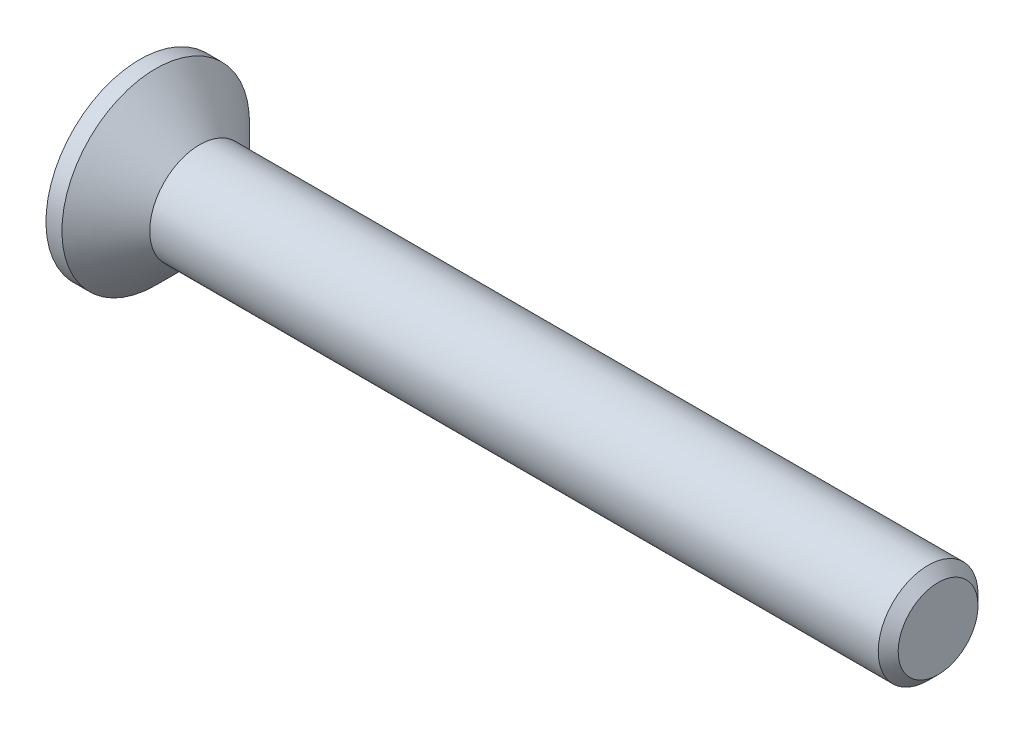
ISO-10303-21;
HEADER;
FILE_DESCRIPTION(('STEP AP214'),'2;1');
FILE_NAME('part.step','',(''),(''),'','','');
FILE_SCHEMA(('AUTOMOTIVE_DESIGN { 1 0 10303 214 1 1 1 1 }'));
ENDSEC;
DATA;
#1=APPLICATION_CONTEXT('core data for automotive mechanical design processes');
#2=APPLICATION_PROTOCOL_DEFINITION('international standard','automotive_design',2000,#1);
#3=PRODUCT_CONTEXT('',#1,'mechanical');
#4=PRODUCT('Part','Part','',(#3));
#5=PRODUCT_RELATED_PRODUCT_CATEGORY('part','',(#4));
#6=PRODUCT_DEFINITION_FORMATION('','',#4);
#7=PRODUCT_DEFINITION_CONTEXT('part definition',#1,'design');
#8=PRODUCT_DEFINITION('design','',#6,#7);
#9=PRODUCT_DEFINITION_SHAPE('','',#8);
#10=(LENGTH_UNIT() NAMED_UNIT(*) SI_UNIT(.MILLI.,.METRE.));
#11=(NAMED_UNIT(*) PLANE_ANGLE_UNIT() SI_UNIT($,.RADIAN.));
#12=(NAMED_UNIT(*) SI_UNIT($,.STERADIAN.) SOLID_ANGLE_UNIT());
#13=UNCERTAINTY_MEASURE_WITH_UNIT(LENGTH_MEASURE(1.E-05),#10,'distance_accuracy_value','');
#14=(GEOMETRIC_REPRESENTATION_CONTEXT(3) GLOBAL_UNCERTAINTY_ASSIGNED_CONTEXT((#13)) GLOBAL_UNIT_ASSIGNED_CONTEXT((#10,
#11,#12)) REPRESENTATION_CONTEXT('',''));
#15=CARTESIAN_POINT('',(0.,0.,0.));
#16=DIRECTION('',(0.,0.,1.));
#17=DIRECTION('',(1.,0.,0.));
#18=AXIS2_PLACEMENT_3D('',#15,#16,#17);
#19=CARTESIAN_POINT('',(0.,0.,0.));
#20=DIRECTION('',(-1.,0.,0.));
#21=DIRECTION('',(0.,-1.,0.));
#22=AXIS2_PLACEMENT_3D('',#19,#20,#21);
#23=CONICAL_SURFACE('',#22,1.25,0.78539816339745);
#24=CARTESIAN_POINT('',(-1.1,0.,0.));
#25=DIRECTION('',(-1.,0.,0.));
#26=DIRECTION('',(0.,-1.,0.));
#27=AXIS2_PLACEMENT_3D('',#24,#25,#26);
#28=CIRCLE('',#27,2.35);
#29=CARTESIAN_POINT('',(-1.1,-2.35,0.));
#30=VERTEX_POINT('',#29);
#31=EDGE_CURVE('E189',#30,#30,#28,.T.);
#32=ORIENTED_EDGE('',*,*,#31,.F.);
#33=EDGE_LOOP('',(#32));
#34=FACE_BOUND('',#33,.T.);
#35=CARTESIAN_POINT('',(0.,0.,0.));
#36=DIRECTION('',(-1.,0.,0.));
#37=DIRECTION('',(0.,-1.,0.));
#38=AXIS2_PLACEMENT_3D('',#35,#36,#37);
#39=CIRCLE('',#38,1.25);
#40=CARTESIAN_POINT('',(0.,-1.25,0.));
#41=VERTEX_POINT('',#40);
#42=EDGE_CURVE('E212',#41,#41,#39,.T.);
#43=ORIENTED_EDGE('',*,*,#42,.T.);
#44=EDGE_LOOP('',(#43));
#45=FACE_BOUND('',#44,.T.);
#46=ADVANCED_FACE('F33',(#34,#45),#23,.T.);
#47=CARTESIAN_POINT('',(-1.5,0.,0.));
#48=DIRECTION('',(-1.,0.,0.));
#49=DIRECTION('',(0.,-1.,0.));
#50=AXIS2_PLACEMENT_3D('',#47,#48,#49);
#51=CYLINDRICAL_SURFACE('',#50,1.25);
#52=CARTESIAN_POINT('',(18.25,0.,0.));
#53=DIRECTION('',(-1.,0.,0.));
#54=DIRECTION('',(0.,-1.,0.));
#55=AXIS2_PLACEMENT_3D('',#52,#53,#54);
#56=CIRCLE('',#55,1.25);
#57=CARTESIAN_POINT('',(18.25,-1.25,0.));
#58=VERTEX_POINT('',#57);
#59=EDGE_CURVE('E41',#58,#58,#56,.T.);
#60=ORIENTED_EDGE('',*,*,#59,.T.);
#61=EDGE_LOOP('',(#60));
#62=FACE_BOUND('',#61,.T.);
#63=ORIENTED_EDGE('',*,*,#42,.F.);
#64=EDGE_LOOP('',(#63));
#65=FACE_BOUND('',#64,.T.);
#66=ADVANCED_FACE('F217',(#62,#65),#51,.T.);
#67=CARTESIAN_POINT('',(18.5,0.,0.));
#68=DIRECTION('',(-1.,0.,0.));
#69=DIRECTION('',(0.,-1.,0.));
#70=AXIS2_PLACEMENT_3D('',#67,#68,#69);
#71=PLANE('',#70);
#72=CARTESIAN_POINT('',(18.5,0.,0.));
#73=DIRECTION('',(-1.,0.,0.));
#74=DIRECTION('',(0.,-1.,0.));
#75=AXIS2_PLACEMENT_3D('',#72,#73,#74);
#76=CIRCLE('',#75,0.999999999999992);
#77=CARTESIAN_POINT('',(18.5,-0.999999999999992,0.));
#78=VERTEX_POINT('',#77);
#79=EDGE_CURVE('E11',#78,#78,#76,.F.);
#80=ORIENTED_EDGE('',*,*,#79,.T.);
#81=EDGE_LOOP('',(#80));
#82=FACE_BOUND('',#81,.T.);
#83=ADVANCED_FACE('F239',(#82),#71,.F.);
#84=CARTESIAN_POINT('',(-1.5,2.35,0.));
#85=DIRECTION('',(1.,0.,0.));
#86=DIRECTION('',(0.,1.,0.));
#87=AXIS2_PLACEMENT_3D('',#84,#85,#86);
#88=PLANE('',#87);
#89=DIRECTION('',(0.,0.,-1.));
#90=VECTOR('',#89,1.);
#91=CARTESIAN_POINT('',(-1.5,0.34,-1.35));
#92=LINE('',#91,#90);
#93=CARTESIAN_POINT('',(-1.5,0.34,-0.34));
#94=VERTEX_POINT('',#93);
#95=CARTESIAN_POINT('',(-1.5,0.34,-1.35));
#96=VERTEX_POINT('',#95);
#97=EDGE_CURVE('E158',#94,#96,#92,.T.);
#98=ORIENTED_EDGE('',*,*,#97,.F.);
#99=DIRECTION('',(0.,-1.,0.));
#100=VECTOR('',#99,1.);
#101=CARTESIAN_POINT('',(-1.5,0.34,-0.34));
#102=LINE('',#101,#100);
#103=CARTESIAN_POINT('',(-1.5,1.35,-0.34));
#104=VERTEX_POINT('',#103);
#105=EDGE_CURVE('E48',#104,#94,#102,.T.);
#106=ORIENTED_EDGE('',*,*,#105,.F.);
#107=DIRECTION('',(0.,0.,-1.));
#108=VECTOR('',#107,1.);
#109=CARTESIAN_POINT('',(-1.5,1.35,-0.34));
#110=LINE('',#109,#108);
#111=CARTESIAN_POINT('',(-1.5,1.35,0.34));
#112=VERTEX_POINT('',#111);
#113=EDGE_CURVE('E185',#112,#104,#110,.T.);
#114=ORIENTED_EDGE('',*,*,#113,.F.);
#115=DIRECTION('',(0.,1.,0.));
#116=VECTOR('',#115,1.);
#117=CARTESIAN_POINT('',(-1.5,1.35,0.34));
#118=LINE('',#117,#116);
#119=CARTESIAN_POINT('',(-1.5,0.34,0.34));
#120=VERTEX_POINT('',#119);
#121=EDGE_CURVE('E183',#120,#112,#118,.T.);
#122=ORIENTED_EDGE('',*,*,#121,.F.);
#123=DIRECTION('',(0.,0.,-1.));
#124=VECTOR('',#123,1.);
#125=CARTESIAN_POINT('',(-1.5,0.34,0.34));
#126=LINE('',#125,#124);
#127=CARTESIAN_POINT('',(-1.5,0.34,1.35));
#128=VERTEX_POINT('',#127);
#129=EDGE_CURVE('E132',#128,#120,#126,.T.);
#130=ORIENTED_EDGE('',*,*,#129,.F.);
#131=DIRECTION('',(0.,1.,0.));
#132=VECTOR('',#131,1.);
#133=CARTESIAN_POINT('',(-1.5,0.34,1.35));
#134=LINE('',#133,#132);
#135=CARTESIAN_POINT('',(-1.5,-0.34,1.35));
#136=VERTEX_POINT('',#135);
#137=EDGE_CURVE('E179',#136,#128,#134,.T.);
#138=ORIENTED_EDGE('',*,*,#137,.F.);
#139=DIRECTION('',(0.,0.,1.));
#140=VECTOR('',#139,1.);
#141=CARTESIAN_POINT('',(-1.5,-0.34,1.35));
#142=LINE('',#141,#140);
#143=CARTESIAN_POINT('',(-1.5,-0.34,0.34));
#144=VERTEX_POINT('',#143);
#145=EDGE_CURVE('E176',#144,#136,#142,.T.);
#146=ORIENTED_EDGE('',*,*,#145,.F.);
#147=DIRECTION('',(0.,1.,0.));
#148=VECTOR('',#147,1.);
#149=CARTESIAN_POINT('',(-1.5,-0.34,0.34));
#150=LINE('',#149,#148);
#151=CARTESIAN_POINT('',(-1.5,-1.35,0.34));
#152=VERTEX_POINT('',#151);
#153=EDGE_CURVE('E173',#152,#144,#150,.T.);
#154=ORIENTED_EDGE('',*,*,#153,.F.);
#155=DIRECTION('',(0.,0.,1.));
#156=VECTOR('',#155,1.);
#157=CARTESIAN_POINT('',(-1.5,-1.35,0.34));
#158=LINE('',#157,#156);
#159=CARTESIAN_POINT('',(-1.5,-1.35,-0.34));
#160=VERTEX_POINT('',#159);
#161=EDGE_CURVE('E170',#160,#152,#158,.T.);
#162=ORIENTED_EDGE('',*,*,#161,.F.);
#163=DIRECTION('',(0.,-1.,0.));
#164=VECTOR('',#163,1.);
#165=CARTESIAN_POINT('',(-1.5,-1.35,-0.34));
#166=LINE('',#165,#164);
#167=CARTESIAN_POINT('',(-1.5,-0.34,-0.34));
#168=VERTEX_POINT('',#167);
#169=EDGE_CURVE('E167',#168,#160,#166,.T.);
#170=ORIENTED_EDGE('',*,*,#169,.F.);
#171=DIRECTION('',(0.,0.,1.));
#172=VECTOR('',#171,1.);
#173=CARTESIAN_POINT('',(-1.5,-0.34,-0.34));
#174=LINE('',#173,#172);
#175=CARTESIAN_POINT('',(-1.5,-0.34,-1.35));
#176=VERTEX_POINT('',#175);
#177=EDGE_CURVE('E164',#176,#168,#174,.T.);
#178=ORIENTED_EDGE('',*,*,#177,.F.);
#179=DIRECTION('',(0.,-1.,0.));
#180=VECTOR('',#179,1.);
#181=CARTESIAN_POINT('',(-1.5,-0.34,-1.35));
#182=LINE('',#181,#180);
#183=EDGE_CURVE('E161',#96,#176,#182,.T.);
#184=ORIENTED_EDGE('',*,*,#183,.F.);
#185=EDGE_LOOP('',(#98,#106,#114,#122,#130,#138,#146,#154,#162,#170,#178,#184));
#186=FACE_BOUND('',#185,.T.);
#187=CARTESIAN_POINT('',(-1.5,0.,0.));
#188=DIRECTION('',(-1.,0.,0.));
#189=DIRECTION('',(0.,-1.,0.));
#190=AXIS2_PLACEMENT_3D('',#187,#188,#189);
#191=CIRCLE('',#190,2.35);
#192=CARTESIAN_POINT('',(-1.5,-2.35,0.));
#193=VERTEX_POINT('',#192);
#194=EDGE_CURVE('E209',#193,#193,#191,.T.);
#195=ORIENTED_EDGE('',*,*,#194,.T.);
#196=EDGE_LOOP('',(#195));
#197=FACE_BOUND('',#196,.T.);
#198=ADVANCED_FACE('F230',(#186,#197),#88,.F.);
#199=CARTESIAN_POINT('',(-1.5,0.,0.));
#200=DIRECTION('',(-1.,0.,0.));
#201=DIRECTION('',(0.,-1.,0.));
#202=AXIS2_PLACEMENT_3D('',#199,#200,#201);
#203=CYLINDRICAL_SURFACE('',#202,2.35);
#204=ORIENTED_EDGE('',*,*,#194,.F.);
#205=EDGE_LOOP('',(#204));
#206=FACE_BOUND('',#205,.T.);
#207=ORIENTED_EDGE('',*,*,#31,.T.);
#208=EDGE_LOOP('',(#207));
#209=FACE_BOUND('',#208,.T.);
#210=ADVANCED_FACE('F222',(#206,#209),#203,.T.);
#211=CARTESIAN_POINT('',(18.25,0.,0.));
#212=DIRECTION('',(-1.,0.,0.));
#213=DIRECTION('',(0.,-1.,0.));
#214=AXIS2_PLACEMENT_3D('',#211,#212,#213);
#215=CONICAL_SURFACE('',#214,1.25,0.785398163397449);
#216=ORIENTED_EDGE('',*,*,#79,.F.);
#217=EDGE_LOOP('',(#216));
#218=FACE_BOUND('',#217,.T.);
#219=ORIENTED_EDGE('',*,*,#59,.F.);
#220=EDGE_LOOP('',(#219));
#221=FACE_BOUND('',#220,.T.);
#222=ADVANCED_FACE('F35',(#218,#221),#215,.T.);
#223=CARTESIAN_POINT('',(-0.25,0.34,-0.34));
#224=DIRECTION('',(0.,0.,-1.));
#225=DIRECTION('',(-1.,0.,0.));
#226=AXIS2_PLACEMENT_3D('',#223,#224,#225);
#227=PLANE('',#226);
#228=ORIENTED_EDGE('',*,*,#105,.T.);
#229=DIRECTION('',(-1.,0.,0.));
#230=VECTOR('',#229,1.);
#231=CARTESIAN_POINT('',(-0.25,0.34,-0.34));
#232=LINE('',#231,#230);
#233=CARTESIAN_POINT('',(-0.25,0.34,-0.34));
#234=VERTEX_POINT('',#233);
#235=EDGE_CURVE('E96',#234,#94,#232,.T.);
#236=ORIENTED_EDGE('',*,*,#235,.F.);
#237=DIRECTION('',(0.,-1.,0.));
#238=VECTOR('',#237,1.);
#239=CARTESIAN_POINT('',(-0.25,0.34,-0.34));
#240=LINE('',#239,#238);
#241=CARTESIAN_POINT('',(-0.25,1.35,-0.34));
#242=VERTEX_POINT('',#241);
#243=EDGE_CURVE('E187',#242,#234,#240,.T.);
#244=ORIENTED_EDGE('',*,*,#243,.F.);
#245=DIRECTION('',(-1.,0.,0.));
#246=VECTOR('',#245,1.);
#247=CARTESIAN_POINT('',(-0.25,1.35,-0.34));
#248=LINE('',#247,#246);
#249=EDGE_CURVE('E56',#242,#104,#248,.T.);
#250=ORIENTED_EDGE('',*,*,#249,.T.);
#251=EDGE_LOOP('',(#228,#236,#244,#250));
#252=FACE_BOUND('',#251,.T.);
#253=ADVANCED_FACE('F221',(#252),#227,.F.);
#254=CARTESIAN_POINT('',(-0.25,1.35,-0.34));
#255=DIRECTION('',(0.,1.,0.));
#256=DIRECTION('',(-1.,0.,0.));
#257=AXIS2_PLACEMENT_3D('',#254,#255,#256);
#258=PLANE('',#257);
#259=ORIENTED_EDGE('',*,*,#113,.T.);
#260=ORIENTED_EDGE('',*,*,#249,.F.);
#261=DIRECTION('',(0.,0.,-1.));
#262=VECTOR('',#261,1.);
#263=CARTESIAN_POINT('',(-0.25,1.35,-0.34));
#264=LINE('',#263,#262);
#265=CARTESIAN_POINT('',(-0.25,1.35,0.34));
#266=VERTEX_POINT('',#265);
#267=EDGE_CURVE('E144',#266,#242,#264,.T.);
#268=ORIENTED_EDGE('',*,*,#267,.F.);
#269=DIRECTION('',(-1.,0.,0.));
#270=VECTOR('',#269,1.);
#271=CARTESIAN_POINT('',(-0.25,1.35,0.34));
#272=LINE('',#271,#270);
#273=EDGE_CURVE('E136',#266,#112,#272,.T.);
#274=ORIENTED_EDGE('',*,*,#273,.T.);
#275=EDGE_LOOP('',(#259,#260,#268,#274));
#276=FACE_BOUND('',#275,.T.);
#277=ADVANCED_FACE('F228',(#276),#258,.F.);
#278=CARTESIAN_POINT('',(-0.25,1.35,0.34));
#279=DIRECTION('',(0.,0.,1.));
#280=DIRECTION('',(1.,0.,0.));
#281=AXIS2_PLACEMENT_3D('',#278,#279,#280);
#282=PLANE('',#281);
#283=ORIENTED_EDGE('',*,*,#121,.T.);
#284=ORIENTED_EDGE('',*,*,#273,.F.);
#285=DIRECTION('',(0.,1.,0.));
#286=VECTOR('',#285,1.);
#287=CARTESIAN_POINT('',(-0.25,1.35,0.34));
#288=LINE('',#287,#286);
#289=CARTESIAN_POINT('',(-0.25,0.34,0.34));
#290=VERTEX_POINT('',#289);
#291=EDGE_CURVE('E140',#290,#266,#288,.T.);
#292=ORIENTED_EDGE('',*,*,#291,.F.);
#293=DIRECTION('',(-1.,0.,0.));
#294=VECTOR('',#293,1.);
#295=CARTESIAN_POINT('',(-0.25,0.34,0.34));
#296=LINE('',#295,#294);
#297=EDGE_CURVE('E125',#290,#120,#296,.T.);
#298=ORIENTED_EDGE('',*,*,#297,.T.);
#299=EDGE_LOOP('',(#283,#284,#292,#298));
#300=FACE_BOUND('',#299,.T.);
#301=ADVANCED_FACE('F141',(#300),#282,.F.);
#302=CARTESIAN_POINT('',(-0.25,0.34,0.34));
#303=DIRECTION('',(0.,1.,0.));
#304=DIRECTION('',(-1.,0.,0.));
#305=AXIS2_PLACEMENT_3D('',#302,#303,#304);
#306=PLANE('',#305);
#307=ORIENTED_EDGE('',*,*,#129,.T.);
#308=ORIENTED_EDGE('',*,*,#297,.F.);
#309=DIRECTION('',(0.,0.,-1.));
#310=VECTOR('',#309,1.);
#311=CARTESIAN_POINT('',(-0.25,0.34,0.34));
#312=LINE('',#311,#310);
#313=CARTESIAN_POINT('',(-0.25,0.34,1.35));
#314=VERTEX_POINT('',#313);
#315=EDGE_CURVE('E129',#314,#290,#312,.T.);
#316=ORIENTED_EDGE('',*,*,#315,.F.);
#317=DIRECTION('',(-1.,0.,0.));
#318=VECTOR('',#317,1.);
#319=CARTESIAN_POINT('',(-0.25,0.34,1.35));
#320=LINE('',#319,#318);
#321=EDGE_CURVE('E137',#314,#128,#320,.T.);
#322=ORIENTED_EDGE('',*,*,#321,.T.);
#323=EDGE_LOOP('',(#307,#308,#316,#322));
#324=FACE_BOUND('',#323,.T.);
#325=ADVANCED_FACE('F127',(#324),#306,.F.);
#326=CARTESIAN_POINT('',(-0.25,0.34,1.35));
#327=DIRECTION('',(0.,0.,1.));
#328=DIRECTION('',(1.,0.,0.));
#329=AXIS2_PLACEMENT_3D('',#326,#327,#328);
#330=PLANE('',#329);
#331=ORIENTED_EDGE('',*,*,#137,.T.);
#332=ORIENTED_EDGE('',*,*,#321,.F.);
#333=DIRECTION('',(0.,1.,0.));
#334=VECTOR('',#333,1.);
#335=CARTESIAN_POINT('',(-0.25,0.34,1.35));
#336=LINE('',#335,#334);
#337=CARTESIAN_POINT('',(-0.25,-0.34,1.35));
#338=VERTEX_POINT('',#337);
#339=EDGE_CURVE('E150',#338,#314,#336,.T.);
#340=ORIENTED_EDGE('',*,*,#339,.F.);
#341=DIRECTION('',(-1.,0.,0.));
#342=VECTOR('',#341,1.);
#343=CARTESIAN_POINT('',(-0.25,-0.34,1.35));
#344=LINE('',#343,#342);
#345=EDGE_CURVE('E192',#338,#136,#344,.T.);
#346=ORIENTED_EDGE('',*,*,#345,.T.);
#347=EDGE_LOOP('',(#331,#332,#340,#346));
#348=FACE_BOUND('',#347,.T.);
#349=ADVANCED_FACE('F277',(#348),#330,.F.);
#350=CARTESIAN_POINT('',(-0.25,-0.34,1.35));
#351=DIRECTION('',(0.,-1.,0.));
#352=DIRECTION('',(1.,0.,0.));
#353=AXIS2_PLACEMENT_3D('',#350,#351,#352);
#354=PLANE('',#353);
#355=ORIENTED_EDGE('',*,*,#145,.T.);
#356=ORIENTED_EDGE('',*,*,#345,.F.);
#357=DIRECTION('',(0.,0.,1.));
#358=VECTOR('',#357,1.);
#359=CARTESIAN_POINT('',(-0.25,-0.34,1.35));
#360=LINE('',#359,#358);
#361=CARTESIAN_POINT('',(-0.25,-0.34,0.34));
#362=VERTEX_POINT('',#361);
#363=EDGE_CURVE('E152',#362,#338,#360,.T.);
#364=ORIENTED_EDGE('',*,*,#363,.F.);
#365=DIRECTION('',(-1.,0.,0.));
#366=VECTOR('',#365,1.);
#367=CARTESIAN_POINT('',(-0.25,-0.34,0.34));
#368=LINE('',#367,#366);
#369=EDGE_CURVE('E194',#362,#144,#368,.T.);
#370=ORIENTED_EDGE('',*,*,#369,.T.);
#371=EDGE_LOOP('',(#355,#356,#364,#370));
#372=FACE_BOUND('',#371,.T.);
#373=ADVANCED_FACE('F273',(#372),#354,.F.);
#374=CARTESIAN_POINT('',(-0.25,-0.34,0.34));
#375=DIRECTION('',(0.,0.,1.));
#376=DIRECTION('',(1.,0.,0.));
#377=AXIS2_PLACEMENT_3D('',#374,#375,#376);
#378=PLANE('',#377);
#379=ORIENTED_EDGE('',*,*,#153,.T.);
#380=ORIENTED_EDGE('',*,*,#369,.F.);
#381=DIRECTION('',(0.,1.,0.));
#382=VECTOR('',#381,1.);
#383=CARTESIAN_POINT('',(-0.25,-0.34,0.34));
#384=LINE('',#383,#382);
#385=CARTESIAN_POINT('',(-0.25,-1.35,0.34));
#386=VERTEX_POINT('',#385);
#387=EDGE_CURVE('E422',#386,#362,#384,.T.);
#388=ORIENTED_EDGE('',*,*,#387,.F.);
#389=DIRECTION('',(-1.,0.,0.));
#390=VECTOR('',#389,1.);
#391=CARTESIAN_POINT('',(-0.25,-1.35,0.34));
#392=LINE('',#391,#390);
#393=EDGE_CURVE('E196',#386,#152,#392,.T.);
#394=ORIENTED_EDGE('',*,*,#393,.T.);
#395=EDGE_LOOP('',(#379,#380,#388,#394));
#396=FACE_BOUND('',#395,.T.);
#397=ADVANCED_FACE('F269',(#396),#378,.F.);
#398=CARTESIAN_POINT('',(-0.25,-1.35,0.34));
#399=DIRECTION('',(0.,-1.,0.));
#400=DIRECTION('',(1.,0.,0.));
#401=AXIS2_PLACEMENT_3D('',#398,#399,#400);
#402=PLANE('',#401);
#403=ORIENTED_EDGE('',*,*,#161,.T.);
#404=ORIENTED_EDGE('',*,*,#393,.F.);
#405=DIRECTION('',(0.,0.,1.));
#406=VECTOR('',#405,1.);
#407=CARTESIAN_POINT('',(-0.25,-1.35,0.34));
#408=LINE('',#407,#406);
#409=CARTESIAN_POINT('',(-0.25,-1.35,-0.34));
#410=VERTEX_POINT('',#409);
#411=EDGE_CURVE('E419',#410,#386,#408,.T.);
#412=ORIENTED_EDGE('',*,*,#411,.F.);
#413=DIRECTION('',(-1.,0.,0.));
#414=VECTOR('',#413,1.);
#415=CARTESIAN_POINT('',(-0.25,-1.35,-0.34));
#416=LINE('',#415,#414);
#417=EDGE_CURVE('E198',#410,#160,#416,.T.);
#418=ORIENTED_EDGE('',*,*,#417,.T.);
#419=EDGE_LOOP('',(#403,#404,#412,#418));
#420=FACE_BOUND('',#419,.T.);
#421=ADVANCED_FACE('F265',(#420),#402,.F.);
#422=CARTESIAN_POINT('',(-0.25,-1.35,-0.34));
#423=DIRECTION('',(0.,0.,-1.));
#424=DIRECTION('',(-1.,0.,0.));
#425=AXIS2_PLACEMENT_3D('',#422,#423,#424);
#426=PLANE('',#425);
#427=ORIENTED_EDGE('',*,*,#169,.T.);
#428=ORIENTED_EDGE('',*,*,#417,.F.);
#429=DIRECTION('',(0.,-1.,0.));
#430=VECTOR('',#429,1.);
#431=CARTESIAN_POINT('',(-0.25,-1.35,-0.34));
#432=LINE('',#431,#430);
#433=CARTESIAN_POINT('',(-0.25,-0.34,-0.34));
#434=VERTEX_POINT('',#433);
#435=EDGE_CURVE('E416',#434,#410,#432,.T.);
#436=ORIENTED_EDGE('',*,*,#435,.F.);
#437=DIRECTION('',(-1.,0.,0.));
#438=VECTOR('',#437,1.);
#439=CARTESIAN_POINT('',(-0.25,-0.34,-0.34));
#440=LINE('',#439,#438);
#441=EDGE_CURVE('E200',#434,#168,#440,.T.);
#442=ORIENTED_EDGE('',*,*,#441,.T.);
#443=EDGE_LOOP('',(#427,#428,#436,#442));
#444=FACE_BOUND('',#443,.T.);
#445=ADVANCED_FACE('F261',(#444),#426,.F.);
#446=CARTESIAN_POINT('',(-0.25,-0.34,-0.34));
#447=DIRECTION('',(0.,-1.,0.));
#448=DIRECTION('',(1.,0.,0.));
#449=AXIS2_PLACEMENT_3D('',#446,#447,#448);
#450=PLANE('',#449);
#451=ORIENTED_EDGE('',*,*,#177,.T.);
#452=ORIENTED_EDGE('',*,*,#441,.F.);
#453=DIRECTION('',(0.,0.,1.));
#454=VECTOR('',#453,1.);
#455=CARTESIAN_POINT('',(-0.25,-0.34,-0.34));
#456=LINE('',#455,#454);
#457=CARTESIAN_POINT('',(-0.25,-0.34,-1.35));
#458=VERTEX_POINT('',#457);
#459=EDGE_CURVE('E413',#458,#434,#456,.T.);
#460=ORIENTED_EDGE('',*,*,#459,.F.);
#461=DIRECTION('',(-1.,0.,0.));
#462=VECTOR('',#461,1.);
#463=CARTESIAN_POINT('',(-0.25,-0.34,-1.35));
#464=LINE('',#463,#462);
#465=EDGE_CURVE('E202',#458,#176,#464,.T.);
#466=ORIENTED_EDGE('',*,*,#465,.T.);
#467=EDGE_LOOP('',(#451,#452,#460,#466));
#468=FACE_BOUND('',#467,.T.);
#469=ADVANCED_FACE('F257',(#468),#450,.F.);
#470=CARTESIAN_POINT('',(-0.25,-0.34,-1.35));
#471=DIRECTION('',(0.,0.,-1.));
#472=DIRECTION('',(-1.,0.,0.));
#473=AXIS2_PLACEMENT_3D('',#470,#471,#472);
#474=PLANE('',#473);
#475=ORIENTED_EDGE('',*,*,#183,.T.);
#476=ORIENTED_EDGE('',*,*,#465,.F.);
#477=DIRECTION('',(0.,-1.,0.));
#478=VECTOR('',#477,1.);
#479=CARTESIAN_POINT('',(-0.25,-0.34,-1.35));
#480=LINE('',#479,#478);
#481=CARTESIAN_POINT('',(-0.25,0.34,-1.35));
#482=VERTEX_POINT('',#481);
#483=EDGE_CURVE('E408',#482,#458,#480,.T.);
#484=ORIENTED_EDGE('',*,*,#483,.F.);
#485=DIRECTION('',(-1.,0.,0.));
#486=VECTOR('',#485,1.);
#487=CARTESIAN_POINT('',(-0.25,0.34,-1.35));
#488=LINE('',#487,#486);
#489=EDGE_CURVE('E204',#482,#96,#488,.T.);
#490=ORIENTED_EDGE('',*,*,#489,.T.);
#491=EDGE_LOOP('',(#475,#476,#484,#490));
#492=FACE_BOUND('',#491,.T.);
#493=ADVANCED_FACE('F253',(#492),#474,.F.);
#494=CARTESIAN_POINT('',(-0.25,0.34,-1.35));
#495=DIRECTION('',(0.,1.,0.));
#496=DIRECTION('',(-1.,0.,0.));
#497=AXIS2_PLACEMENT_3D('',#494,#495,#496);
#498=PLANE('',#497);
#499=ORIENTED_EDGE('',*,*,#97,.T.);
#500=ORIENTED_EDGE('',*,*,#489,.F.);
#501=DIRECTION('',(0.,0.,-1.));
#502=VECTOR('',#501,1.);
#503=CARTESIAN_POINT('',(-0.25,0.34,-1.35));
#504=LINE('',#503,#502);
#505=EDGE_CURVE('E406',#234,#482,#504,.T.);
#506=ORIENTED_EDGE('',*,*,#505,.F.);
#507=ORIENTED_EDGE('',*,*,#235,.T.);
#508=EDGE_LOOP('',(#499,#500,#506,#507));
#509=FACE_BOUND('',#508,.T.);
#510=ADVANCED_FACE('F250',(#509),#498,.F.);
#511=CARTESIAN_POINT('',(-0.25,0.,0.));
#512=DIRECTION('',(1.,0.,0.));
#513=DIRECTION('',(0.,0.,-1.));
#514=AXIS2_PLACEMENT_3D('',#511,#512,#513);
#515=PLANE('',#514);
#516=ORIENTED_EDGE('',*,*,#243,.T.);
#517=ORIENTED_EDGE('',*,*,#505,.T.);
#518=ORIENTED_EDGE('',*,*,#483,.T.);
#519=ORIENTED_EDGE('',*,*,#459,.T.);
#520=ORIENTED_EDGE('',*,*,#435,.T.);
#521=ORIENTED_EDGE('',*,*,#411,.T.);
#522=ORIENTED_EDGE('',*,*,#387,.T.);
#523=ORIENTED_EDGE('',*,*,#363,.T.);
#524=ORIENTED_EDGE('',*,*,#339,.T.);
#525=ORIENTED_EDGE('',*,*,#315,.T.);
#526=ORIENTED_EDGE('',*,*,#291,.T.);
#527=ORIENTED_EDGE('',*,*,#267,.T.);
#528=EDGE_LOOP('',(#516,#517,#518,#519,#520,#521,#522,#523,#524,#525,#526,#527));
#529=FACE_BOUND('',#528,.T.);
#530=ADVANCED_FACE('F147',(#529),#515,.F.);
#531=CLOSED_SHELL('',(#46,#66,#83,#198,#210,#222,#253,#277,#301,#325,#349,#373,#397,#421,#445,
#469,#493,#510,#530));
#532=MANIFOLD_SOLID_BREP('B2',#531);
#533=ADVANCED_BREP_SHAPE_REPRESENTATION('',(#18,#532),#14);
#534=SHAPE_DEFINITION_REPRESENTATION(#9,#533);
ENDSEC;
END-ISO-10303-21;
